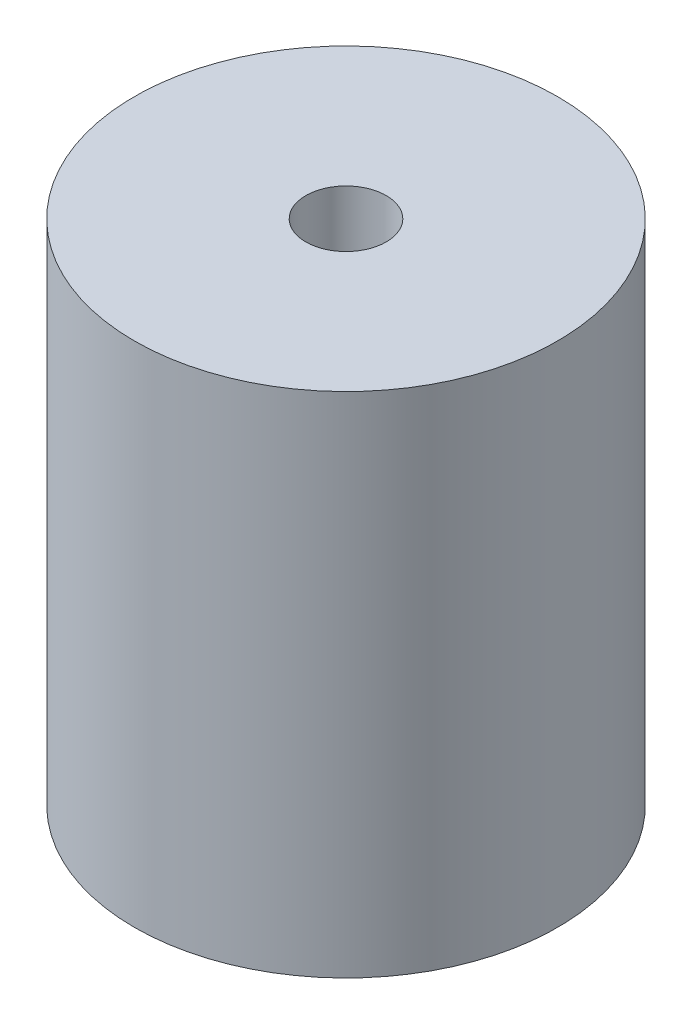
from build123d import *

# Parameters (mm, degrees)
SKETCH1_R      = 5
SKETCH1_R_2    = 0.95
EXTRUDE1_DEPTH = 12


with BuildPart() as part:
    # Sketch1 → Extrude1 (new body)
    with BuildSketch(Plane(origin=(0, 0, 0), x_dir=(1, 0, 0), z_dir=(0, 1, 0))):
        with Locations(Location((0, 0, 0), (0, 0, 270))):
            Circle(SKETCH1_R)
        with Locations(Location((0, 0, 0), (0, 0, 270))):
            Circle(SKETCH1_R_2, mode=Mode.SUBTRACT)
    extrude(amount=EXTRUDE1_DEPTH)


solid = part.part
